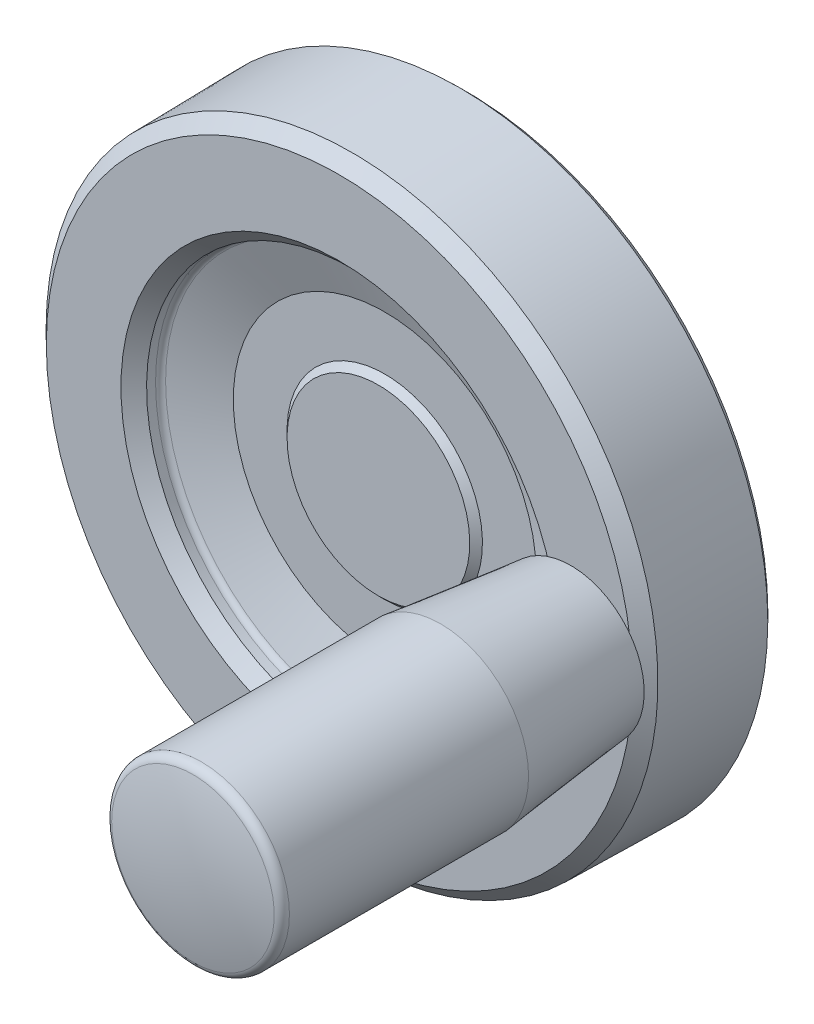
ISO-10303-21;
HEADER;
FILE_DESCRIPTION(('STEP AP214'),'2;1');
FILE_NAME('part.step','',(''),(''),'','','');
FILE_SCHEMA(('AUTOMOTIVE_DESIGN { 1 0 10303 214 1 1 1 1 }'));
ENDSEC;
DATA;
#1=APPLICATION_CONTEXT('core data for automotive mechanical design processes');
#2=APPLICATION_PROTOCOL_DEFINITION('international standard','automotive_design',2000,#1);
#3=PRODUCT_CONTEXT('',#1,'mechanical');
#4=PRODUCT('Part','Part','',(#3));
#5=PRODUCT_RELATED_PRODUCT_CATEGORY('part','',(#4));
#6=PRODUCT_DEFINITION_FORMATION('','',#4);
#7=PRODUCT_DEFINITION_CONTEXT('part definition',#1,'design');
#8=PRODUCT_DEFINITION('design','',#6,#7);
#9=PRODUCT_DEFINITION_SHAPE('','',#8);
#10=(LENGTH_UNIT() NAMED_UNIT(*) SI_UNIT(.MILLI.,.METRE.));
#11=(NAMED_UNIT(*) PLANE_ANGLE_UNIT() SI_UNIT($,.RADIAN.));
#12=(NAMED_UNIT(*) SI_UNIT($,.STERADIAN.) SOLID_ANGLE_UNIT());
#13=UNCERTAINTY_MEASURE_WITH_UNIT(LENGTH_MEASURE(1.E-05),#10,'distance_accuracy_value','');
#14=(GEOMETRIC_REPRESENTATION_CONTEXT(3) GLOBAL_UNCERTAINTY_ASSIGNED_CONTEXT((#13)) GLOBAL_UNIT_ASSIGNED_CONTEXT((#10,
#11,#12)) REPRESENTATION_CONTEXT('',''));
#15=CARTESIAN_POINT('',(0.,0.,0.));
#16=DIRECTION('',(0.,0.,1.));
#17=DIRECTION('',(1.,0.,0.));
#18=AXIS2_PLACEMENT_3D('',#15,#16,#17);
#19=CARTESIAN_POINT('',(24.,0.,14.9999999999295));
#20=DIRECTION('',(0.,0.,-1.));
#21=DIRECTION('',(-1.,0.,0.));
#22=AXIS2_PLACEMENT_3D('',#19,#20,#21);
#23=CONICAL_SURFACE('',#22,2.99999999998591,0.785398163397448);
#24=CARTESIAN_POINT('',(24.,0.,15.3067499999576));
#25=DIRECTION('',(0.,0.,1.));
#26=DIRECTION('',(0.,1.,0.));
#27=AXIS2_PLACEMENT_3D('',#24,#25,#26);
#28=CIRCLE('',#27,2.69324999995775);
#29=CARTESIAN_POINT('',(24.,2.69324999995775,15.3067499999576));
#30=VERTEX_POINT('',#29);
#31=EDGE_CURVE('E756',#30,#30,#28,.T.);
#32=ORIENTED_EDGE('',*,*,#31,.T.);
#33=EDGE_LOOP('',(#32));
#34=FACE_BOUND('',#33,.T.);
#35=CARTESIAN_POINT('',(24.,0.,14.9999999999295));
#36=DIRECTION('',(0.,0.,-1.));
#37=DIRECTION('',(-1.,0.,0.));
#38=AXIS2_PLACEMENT_3D('',#35,#36,#37);
#39=CIRCLE('',#38,2.9999999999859);
#40=CARTESIAN_POINT('',(21.0000000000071,0.,14.9999999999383));
#41=VERTEX_POINT('',#40);
#42=EDGE_CURVE('E18',#41,#41,#39,.T.);
#43=ORIENTED_EDGE('',*,*,#42,.T.);
#44=EDGE_LOOP('',(#43));
#45=FACE_BOUND('',#44,.T.);
#46=ADVANCED_FACE('F14',(#34,#45),#23,.F.);
#47=CARTESIAN_POINT('',(24.,0.,15.613499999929));
#48=DIRECTION('',(0.,0.,1.));
#49=DIRECTION('',(-1.,0.,0.));
#50=AXIS2_PLACEMENT_3D('',#47,#48,#49);
#51=CONICAL_SURFACE('',#50,2.99999999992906,0.785398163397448);
#52=CARTESIAN_POINT('',(24.,0.,15.));
#53=DIRECTION('',(0.,0.,1.));
#54=DIRECTION('',(-1.,0.,0.));
#55=AXIS2_PLACEMENT_3D('',#52,#53,#54);
#56=CIRCLE('',#55,2.38650000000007);
#57=CARTESIAN_POINT('',(21.6134999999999,0.,15.));
#58=VERTEX_POINT('',#57);
#59=EDGE_CURVE('E759',#58,#58,#56,.T.);
#60=ORIENTED_EDGE('',*,*,#59,.T.);
#61=EDGE_LOOP('',(#60));
#62=FACE_BOUND('',#61,.T.);
#63=ORIENTED_EDGE('',*,*,#31,.F.);
#64=EDGE_LOOP('',(#63));
#65=FACE_BOUND('',#64,.T.);
#66=ADVANCED_FACE('F240',(#62,#65),#51,.T.);
#67=CARTESIAN_POINT('',(24.,0.,15.));
#68=DIRECTION('',(0.,0.,1.));
#69=DIRECTION('',(-1.,0.,0.));
#70=AXIS2_PLACEMENT_3D('',#67,#68,#69);
#71=PLANE('',#70);
#72=DIRECTION('',(0.866025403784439,-0.5,0.));
#73=VECTOR('',#72,1.);
#74=CARTESIAN_POINT('',(25.5,0.866025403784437,15.));
#75=LINE('',#74,#73);
#76=CARTESIAN_POINT('',(24.,1.73205080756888,15.));
#77=VERTEX_POINT('',#76);
#78=CARTESIAN_POINT('',(25.5,0.866025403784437,15.));
#79=VERTEX_POINT('',#78);
#80=EDGE_CURVE('E762',#77,#79,#75,.T.);
#81=ORIENTED_EDGE('',*,*,#80,.F.);
#82=DIRECTION('',(0.866025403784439,0.5,0.));
#83=VECTOR('',#82,1.);
#84=CARTESIAN_POINT('',(24.,1.73205080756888,15.));
#85=LINE('',#84,#83);
#86=CARTESIAN_POINT('',(22.5,0.866025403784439,15.));
#87=VERTEX_POINT('',#86);
#88=EDGE_CURVE('E764',#87,#77,#85,.T.);
#89=ORIENTED_EDGE('',*,*,#88,.F.);
#90=DIRECTION('',(0.,-1.,0.));
#91=VECTOR('',#90,1.);
#92=CARTESIAN_POINT('',(22.5,0.866025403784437,15.));
#93=LINE('',#92,#91);
#94=CARTESIAN_POINT('',(22.5,-0.86602540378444,15.));
#95=VERTEX_POINT('',#94);
#96=EDGE_CURVE('E767',#95,#87,#93,.F.);
#97=ORIENTED_EDGE('',*,*,#96,.F.);
#98=DIRECTION('',(-0.866025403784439,0.5,0.));
#99=VECTOR('',#98,1.);
#100=CARTESIAN_POINT('',(22.5,-0.866025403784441,15.));
#101=LINE('',#100,#99);
#102=CARTESIAN_POINT('',(24.,-1.73205080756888,15.));
#103=VERTEX_POINT('',#102);
#104=EDGE_CURVE('E770',#103,#95,#101,.T.);
#105=ORIENTED_EDGE('',*,*,#104,.F.);
#106=DIRECTION('',(-0.866025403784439,-0.5,0.));
#107=VECTOR('',#106,1.);
#108=CARTESIAN_POINT('',(24.,-1.73205080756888,15.));
#109=LINE('',#108,#107);
#110=CARTESIAN_POINT('',(25.5,-0.866025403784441,15.));
#111=VERTEX_POINT('',#110);
#112=EDGE_CURVE('E773',#111,#103,#109,.T.);
#113=ORIENTED_EDGE('',*,*,#112,.F.);
#114=DIRECTION('',(0.,-1.,0.));
#115=VECTOR('',#114,1.);
#116=CARTESIAN_POINT('',(25.5,0.,15.));
#117=LINE('',#116,#115);
#118=EDGE_CURVE('E776',#79,#111,#117,.T.);
#119=ORIENTED_EDGE('',*,*,#118,.F.);
#120=EDGE_LOOP('',(#81,#89,#97,#105,#113,#119));
#121=FACE_BOUND('',#120,.T.);
#122=ORIENTED_EDGE('',*,*,#59,.F.);
#123=EDGE_LOOP('',(#122));
#124=FACE_BOUND('',#123,.T.);
#125=ADVANCED_FACE('F244',(#121,#124),#71,.F.);
#126=CARTESIAN_POINT('',(25.5,0.866025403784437,18.25));
#127=DIRECTION('',(-0.5,-0.866025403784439,0.));
#128=DIRECTION('',(0.866025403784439,-0.5,0.));
#129=AXIS2_PLACEMENT_3D('',#126,#127,#128);
#130=PLANE('',#129);
#131=DIRECTION('',(0.866025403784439,-0.5,0.));
#132=VECTOR('',#131,1.);
#133=CARTESIAN_POINT('',(25.5,0.866025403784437,18.25));
#134=LINE('',#133,#132);
#135=CARTESIAN_POINT('',(24.7500000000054,1.29903810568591,18.2499999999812));
#136=VERTEX_POINT('',#135);
#137=CARTESIAN_POINT('',(24.,1.73205080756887,18.25));
#138=VERTEX_POINT('',#137);
#139=EDGE_CURVE('E779',#136,#138,#134,.F.);
#140=ORIENTED_EDGE('',*,*,#139,.T.);
#141=DIRECTION('',(0.,0.,1.));
#142=VECTOR('',#141,1.);
#143=CARTESIAN_POINT('',(24.,1.73205080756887,18.25));
#144=LINE('',#143,#142);
#145=EDGE_CURVE('E781',#138,#77,#144,.F.);
#146=ORIENTED_EDGE('',*,*,#145,.T.);
#147=ORIENTED_EDGE('',*,*,#80,.T.);
#148=DIRECTION('',(0.,0.,-1.));
#149=VECTOR('',#148,1.);
#150=CARTESIAN_POINT('',(25.5,0.866025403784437,18.25));
#151=LINE('',#150,#149);
#152=CARTESIAN_POINT('',(25.5,0.866025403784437,18.25));
#153=VERTEX_POINT('',#152);
#154=EDGE_CURVE('E784',#153,#79,#151,.T.);
#155=ORIENTED_EDGE('',*,*,#154,.F.);
#156=DIRECTION('',(0.866025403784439,-0.5,0.));
#157=VECTOR('',#156,1.);
#158=CARTESIAN_POINT('',(25.5,0.866025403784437,18.25));
#159=LINE('',#158,#157);
#160=EDGE_CURVE('E787',#153,#136,#159,.F.);
#161=ORIENTED_EDGE('',*,*,#160,.T.);
#162=EDGE_LOOP('',(#140,#146,#147,#155,#161));
#163=FACE_BOUND('',#162,.T.);
#164=ADVANCED_FACE('F248',(#163),#130,.T.);
#165=CARTESIAN_POINT('',(24.,1.73205080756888,18.25));
#166=DIRECTION('',(0.5,-0.866025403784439,0.));
#167=DIRECTION('',(0.866025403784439,0.5,0.));
#168=AXIS2_PLACEMENT_3D('',#165,#166,#167);
#169=PLANE('',#168);
#170=DIRECTION('',(0.866025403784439,0.5,0.));
#171=VECTOR('',#170,1.);
#172=CARTESIAN_POINT('',(24.,1.73205080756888,18.25));
#173=LINE('',#172,#171);
#174=CARTESIAN_POINT('',(23.2499999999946,1.29903810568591,18.2499999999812));
#175=VERTEX_POINT('',#174);
#176=CARTESIAN_POINT('',(22.5,0.866025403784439,18.25));
#177=VERTEX_POINT('',#176);
#178=EDGE_CURVE('E790',#175,#177,#173,.F.);
#179=ORIENTED_EDGE('',*,*,#178,.T.);
#180=DIRECTION('',(0.,0.,1.));
#181=VECTOR('',#180,1.);
#182=CARTESIAN_POINT('',(22.5,0.86602540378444,18.25));
#183=LINE('',#182,#181);
#184=EDGE_CURVE('E792',#177,#87,#183,.F.);
#185=ORIENTED_EDGE('',*,*,#184,.T.);
#186=ORIENTED_EDGE('',*,*,#88,.T.);
#187=ORIENTED_EDGE('',*,*,#145,.F.);
#188=DIRECTION('',(0.866025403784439,0.5,0.));
#189=VECTOR('',#188,1.);
#190=CARTESIAN_POINT('',(24.,1.73205080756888,18.25));
#191=LINE('',#190,#189);
#192=EDGE_CURVE('E795',#138,#175,#191,.F.);
#193=ORIENTED_EDGE('',*,*,#192,.T.);
#194=EDGE_LOOP('',(#179,#185,#186,#187,#193));
#195=FACE_BOUND('',#194,.T.);
#196=ADVANCED_FACE('F252',(#195),#169,.T.);
#197=CARTESIAN_POINT('',(22.5,0.866025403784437,18.25));
#198=DIRECTION('',(1.,0.,0.));
#199=DIRECTION('',(0.,0.,1.));
#200=AXIS2_PLACEMENT_3D('',#197,#198,#199);
#201=PLANE('',#200);
#202=DIRECTION('',(0.,-1.,0.));
#203=VECTOR('',#202,1.);
#204=CARTESIAN_POINT('',(22.5,0.866025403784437,18.25));
#205=LINE('',#204,#203);
#206=CARTESIAN_POINT('',(22.4999999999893,0.,18.2499999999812));
#207=VERTEX_POINT('',#206);
#208=CARTESIAN_POINT('',(22.5,-0.86602540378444,18.25));
#209=VERTEX_POINT('',#208);
#210=EDGE_CURVE('E798',#207,#209,#205,.T.);
#211=ORIENTED_EDGE('',*,*,#210,.T.);
#212=DIRECTION('',(0.,0.,1.));
#213=VECTOR('',#212,1.);
#214=CARTESIAN_POINT('',(22.5,-0.86602540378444,18.25));
#215=LINE('',#214,#213);
#216=EDGE_CURVE('E800',#95,#209,#215,.T.);
#217=ORIENTED_EDGE('',*,*,#216,.F.);
#218=ORIENTED_EDGE('',*,*,#96,.T.);
#219=ORIENTED_EDGE('',*,*,#184,.F.);
#220=DIRECTION('',(0.,-1.,0.));
#221=VECTOR('',#220,1.);
#222=CARTESIAN_POINT('',(22.5,0.866025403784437,18.25));
#223=LINE('',#222,#221);
#224=EDGE_CURVE('E803',#177,#207,#223,.T.);
#225=ORIENTED_EDGE('',*,*,#224,.T.);
#226=EDGE_LOOP('',(#211,#217,#218,#219,#225));
#227=FACE_BOUND('',#226,.T.);
#228=ADVANCED_FACE('F256',(#227),#201,.T.);
#229=CARTESIAN_POINT('',(22.5,-0.866025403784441,18.25));
#230=DIRECTION('',(0.5,0.866025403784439,0.));
#231=DIRECTION('',(-0.866025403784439,0.5,0.));
#232=AXIS2_PLACEMENT_3D('',#229,#230,#231);
#233=PLANE('',#232);
#234=DIRECTION('',(0.866025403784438,-0.5,0.));
#235=VECTOR('',#234,1.);
#236=CARTESIAN_POINT('',(23.25,-1.29903810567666,18.25));
#237=LINE('',#236,#235);
#238=CARTESIAN_POINT('',(23.2499999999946,-1.29903810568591,18.2499999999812));
#239=VERTEX_POINT('',#238);
#240=CARTESIAN_POINT('',(24.,-1.73205080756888,18.25));
#241=VERTEX_POINT('',#240);
#242=EDGE_CURVE('E806',#239,#241,#237,.T.);
#243=ORIENTED_EDGE('',*,*,#242,.T.);
#244=DIRECTION('',(0.,0.,1.));
#245=VECTOR('',#244,1.);
#246=CARTESIAN_POINT('',(24.,-1.73205080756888,18.25));
#247=LINE('',#246,#245);
#248=EDGE_CURVE('E808',#103,#241,#247,.T.);
#249=ORIENTED_EDGE('',*,*,#248,.F.);
#250=ORIENTED_EDGE('',*,*,#104,.T.);
#251=ORIENTED_EDGE('',*,*,#216,.T.);
#252=DIRECTION('',(-0.866025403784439,0.5,0.));
#253=VECTOR('',#252,1.);
#254=CARTESIAN_POINT('',(22.5,-0.866025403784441,18.25));
#255=LINE('',#254,#253);
#256=EDGE_CURVE('E811',#209,#239,#255,.F.);
#257=ORIENTED_EDGE('',*,*,#256,.T.);
#258=EDGE_LOOP('',(#243,#249,#250,#251,#257));
#259=FACE_BOUND('',#258,.T.);
#260=ADVANCED_FACE('F260',(#259),#233,.T.);
#261=CARTESIAN_POINT('',(24.,-1.73205080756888,18.25));
#262=DIRECTION('',(-0.5,0.866025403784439,0.));
#263=DIRECTION('',(-0.866025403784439,-0.5,0.));
#264=AXIS2_PLACEMENT_3D('',#261,#262,#263);
#265=PLANE('',#264);
#266=DIRECTION('',(0.866025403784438,0.5,0.));
#267=VECTOR('',#266,1.);
#268=CARTESIAN_POINT('',(24.75,-1.29903810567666,18.25));
#269=LINE('',#268,#267);
#270=CARTESIAN_POINT('',(24.7500000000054,-1.29903810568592,18.2499999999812));
#271=VERTEX_POINT('',#270);
#272=CARTESIAN_POINT('',(25.5,-0.866025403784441,18.25));
#273=VERTEX_POINT('',#272);
#274=EDGE_CURVE('E814',#271,#273,#269,.T.);
#275=ORIENTED_EDGE('',*,*,#274,.T.);
#276=DIRECTION('',(0.,0.,-1.));
#277=VECTOR('',#276,1.);
#278=CARTESIAN_POINT('',(25.5,-0.866025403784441,18.25));
#279=LINE('',#278,#277);
#280=EDGE_CURVE('E816',#111,#273,#279,.F.);
#281=ORIENTED_EDGE('',*,*,#280,.F.);
#282=ORIENTED_EDGE('',*,*,#112,.T.);
#283=ORIENTED_EDGE('',*,*,#248,.T.);
#284=DIRECTION('',(-0.866025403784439,-0.5,0.));
#285=VECTOR('',#284,1.);
#286=CARTESIAN_POINT('',(24.,-1.73205080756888,18.25));
#287=LINE('',#286,#285);
#288=EDGE_CURVE('E819',#241,#271,#287,.F.);
#289=ORIENTED_EDGE('',*,*,#288,.T.);
#290=EDGE_LOOP('',(#275,#281,#282,#283,#289));
#291=FACE_BOUND('',#290,.T.);
#292=ADVANCED_FACE('F264',(#291),#265,.T.);
#293=CARTESIAN_POINT('',(25.5,-0.866025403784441,18.25));
#294=DIRECTION('',(-1.,0.,0.));
#295=DIRECTION('',(0.,0.,-1.));
#296=AXIS2_PLACEMENT_3D('',#293,#294,#295);
#297=PLANE('',#296);
#298=DIRECTION('',(0.,-1.,0.));
#299=VECTOR('',#298,1.);
#300=CARTESIAN_POINT('',(25.5,-0.866025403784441,18.25));
#301=LINE('',#300,#299);
#302=CARTESIAN_POINT('',(25.5000000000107,0.,18.2499999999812));
#303=VERTEX_POINT('',#302);
#304=EDGE_CURVE('E822',#303,#153,#301,.F.);
#305=ORIENTED_EDGE('',*,*,#304,.T.);
#306=ORIENTED_EDGE('',*,*,#154,.T.);
#307=ORIENTED_EDGE('',*,*,#118,.T.);
#308=ORIENTED_EDGE('',*,*,#280,.T.);
#309=DIRECTION('',(0.,-1.,0.));
#310=VECTOR('',#309,1.);
#311=CARTESIAN_POINT('',(25.5,-0.866025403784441,18.25));
#312=LINE('',#311,#310);
#313=EDGE_CURVE('E825',#273,#303,#312,.F.);
#314=ORIENTED_EDGE('',*,*,#313,.T.);
#315=EDGE_LOOP('',(#305,#306,#307,#308,#314));
#316=FACE_BOUND('',#315,.T.);
#317=ADVANCED_FACE('F268',(#316),#297,.T.);
#318=CARTESIAN_POINT('',(24.,0.,18.25));
#319=DIRECTION('',(0.,0.,1.));
#320=DIRECTION('',(-1.,0.,0.));
#321=AXIS2_PLACEMENT_3D('',#318,#319,#320);
#322=PLANE('',#321);
#323=ORIENTED_EDGE('',*,*,#192,.F.);
#324=ORIENTED_EDGE('',*,*,#139,.F.);
#325=CARTESIAN_POINT('',(24.,0.,18.2499999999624));
#326=DIRECTION('',(0.,0.,-1.));
#327=DIRECTION('',(0.,1.,0.));
#328=AXIS2_PLACEMENT_3D('',#325,#326,#327);
#329=CIRCLE('',#328,1.50000000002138);
#330=EDGE_CURVE('E828',#175,#136,#329,.T.);
#331=ORIENTED_EDGE('',*,*,#330,.F.);
#332=EDGE_LOOP('',(#323,#324,#331));
#333=FACE_BOUND('',#332,.T.);
#334=ADVANCED_FACE('F272',(#333),#322,.F.);
#335=CARTESIAN_POINT('',(24.,0.,18.25));
#336=DIRECTION('',(0.,0.,1.));
#337=DIRECTION('',(-1.,0.,0.));
#338=AXIS2_PLACEMENT_3D('',#335,#336,#337);
#339=PLANE('',#338);
#340=ORIENTED_EDGE('',*,*,#160,.F.);
#341=ORIENTED_EDGE('',*,*,#304,.F.);
#342=CARTESIAN_POINT('',(24.,0.,18.2499999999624));
#343=DIRECTION('',(0.,0.,-1.));
#344=DIRECTION('',(0.,1.,0.));
#345=AXIS2_PLACEMENT_3D('',#342,#343,#344);
#346=CIRCLE('',#345,1.50000000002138);
#347=EDGE_CURVE('E831',#136,#303,#346,.T.);
#348=ORIENTED_EDGE('',*,*,#347,.F.);
#349=EDGE_LOOP('',(#340,#341,#348));
#350=FACE_BOUND('',#349,.T.);
#351=ADVANCED_FACE('F276',(#350),#339,.F.);
#352=CARTESIAN_POINT('',(24.,0.,18.25));
#353=DIRECTION('',(0.,0.,1.));
#354=DIRECTION('',(-1.,0.,0.));
#355=AXIS2_PLACEMENT_3D('',#352,#353,#354);
#356=PLANE('',#355);
#357=ORIENTED_EDGE('',*,*,#224,.F.);
#358=ORIENTED_EDGE('',*,*,#178,.F.);
#359=CARTESIAN_POINT('',(24.,0.,18.2499999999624));
#360=DIRECTION('',(0.,0.,-1.));
#361=DIRECTION('',(0.,1.,0.));
#362=AXIS2_PLACEMENT_3D('',#359,#360,#361);
#363=CIRCLE('',#362,1.50000000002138);
#364=EDGE_CURVE('E834',#175,#207,#363,.F.);
#365=ORIENTED_EDGE('',*,*,#364,.T.);
#366=EDGE_LOOP('',(#357,#358,#365));
#367=FACE_BOUND('',#366,.T.);
#368=ADVANCED_FACE('F280',(#367),#356,.F.);
#369=CARTESIAN_POINT('',(24.,0.,18.25));
#370=DIRECTION('',(0.,0.,1.));
#371=DIRECTION('',(-1.,0.,0.));
#372=AXIS2_PLACEMENT_3D('',#369,#370,#371);
#373=PLANE('',#372);
#374=ORIENTED_EDGE('',*,*,#256,.F.);
#375=ORIENTED_EDGE('',*,*,#210,.F.);
#376=CARTESIAN_POINT('',(24.,0.,18.2499999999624));
#377=DIRECTION('',(0.,0.,-1.));
#378=DIRECTION('',(0.,1.,0.));
#379=AXIS2_PLACEMENT_3D('',#376,#377,#378);
#380=CIRCLE('',#379,1.50000000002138);
#381=EDGE_CURVE('E837',#207,#239,#380,.F.);
#382=ORIENTED_EDGE('',*,*,#381,.T.);
#383=EDGE_LOOP('',(#374,#375,#382));
#384=FACE_BOUND('',#383,.T.);
#385=ADVANCED_FACE('F284',(#384),#373,.F.);
#386=CARTESIAN_POINT('',(24.,0.,18.25));
#387=DIRECTION('',(0.,0.,1.));
#388=DIRECTION('',(-1.,0.,0.));
#389=AXIS2_PLACEMENT_3D('',#386,#387,#388);
#390=PLANE('',#389);
#391=ORIENTED_EDGE('',*,*,#288,.F.);
#392=ORIENTED_EDGE('',*,*,#242,.F.);
#393=CARTESIAN_POINT('',(24.,0.,18.2499999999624));
#394=DIRECTION('',(0.,0.,-1.));
#395=DIRECTION('',(0.,1.,0.));
#396=AXIS2_PLACEMENT_3D('',#393,#394,#395);
#397=CIRCLE('',#396,1.50000000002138);
#398=EDGE_CURVE('E725',#239,#271,#397,.F.);
#399=ORIENTED_EDGE('',*,*,#398,.T.);
#400=EDGE_LOOP('',(#391,#392,#399));
#401=FACE_BOUND('',#400,.T.);
#402=ADVANCED_FACE('F288',(#401),#390,.F.);
#403=CARTESIAN_POINT('',(24.,0.,18.25));
#404=DIRECTION('',(0.,0.,1.));
#405=DIRECTION('',(-1.,0.,0.));
#406=AXIS2_PLACEMENT_3D('',#403,#404,#405);
#407=PLANE('',#406);
#408=ORIENTED_EDGE('',*,*,#313,.F.);
#409=ORIENTED_EDGE('',*,*,#274,.F.);
#410=CARTESIAN_POINT('',(24.,0.,18.2499999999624));
#411=DIRECTION('',(0.,0.,-1.));
#412=DIRECTION('',(0.,1.,0.));
#413=AXIS2_PLACEMENT_3D('',#410,#411,#412);
#414=CIRCLE('',#413,1.50000000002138);
#415=EDGE_CURVE('E720',#303,#271,#414,.T.);
#416=ORIENTED_EDGE('',*,*,#415,.F.);
#417=EDGE_LOOP('',(#408,#409,#416));
#418=FACE_BOUND('',#417,.T.);
#419=ADVANCED_FACE('F291',(#418),#407,.F.);
#420=CARTESIAN_POINT('',(24.,0.,18.2500000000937));
#421=DIRECTION('',(0.,0.,-1.));
#422=DIRECTION('',(0.,1.,0.));
#423=AXIS2_PLACEMENT_3D('',#420,#421,#422);
#424=CONICAL_SURFACE('',#423,1.499999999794,1.04719755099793);
#425=CARTESIAN_POINT('',(23.9999999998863,0.,19.1160254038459));
#426=VERTEX_POINT('',#425);
#427=VERTEX_LOOP('',#426);
#428=FACE_BOUND('',#427,.T.);
#429=ORIENTED_EDGE('',*,*,#398,.F.);
#430=ORIENTED_EDGE('',*,*,#381,.F.);
#431=ORIENTED_EDGE('',*,*,#364,.F.);
#432=ORIENTED_EDGE('',*,*,#330,.T.);
#433=ORIENTED_EDGE('',*,*,#347,.T.);
#434=ORIENTED_EDGE('',*,*,#415,.T.);
#435=EDGE_LOOP('',(#429,#430,#431,#432,#433,#434));
#436=FACE_BOUND('',#435,.T.);
#437=ADVANCED_FACE('F16',(#428,#436),#424,.F.);
#438=CARTESIAN_POINT('',(0.,0.,0.));
#439=DIRECTION('',(0.,0.,1.));
#440=DIRECTION('',(1.,0.,0.));
#441=AXIS2_PLACEMENT_3D('',#438,#439,#440);
#442=CYLINDRICAL_SURFACE('',#441,21.);
#443=CARTESIAN_POINT('',(0.,0.,15.));
#444=DIRECTION('',(0.,0.,1.));
#445=DIRECTION('',(1.,0.,0.));
#446=AXIS2_PLACEMENT_3D('',#443,#444,#445);
#447=CIRCLE('',#446,21.);
#448=EDGE_CURVE('E24',#41,#41,#447,.T.);
#449=ORIENTED_EDGE('',*,*,#448,.F.);
#450=EDGE_LOOP('',(#449));
#451=FACE_BOUND('',#450,.T.);
#452=CARTESIAN_POINT('',(0.,0.,15.9408336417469));
#453=DIRECTION('',(0.,0.,1.));
#454=DIRECTION('',(1.,0.,0.));
#455=AXIS2_PLACEMENT_3D('',#452,#453,#454);
#456=CIRCLE('',#455,21.);
#457=CARTESIAN_POINT('',(21.,0.,15.9408336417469));
#458=VERTEX_POINT('',#457);
#459=EDGE_CURVE('E718',#458,#458,#456,.F.);
#460=ORIENTED_EDGE('',*,*,#459,.F.);
#461=EDGE_LOOP('',(#460));
#462=FACE_BOUND('',#461,.T.);
#463=ADVANCED_FACE('F207',(#451,#462),#442,.F.);
#464=CARTESIAN_POINT('',(0.,0.,15.9408336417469));
#465=DIRECTION('',(0.,0.,-1.));
#466=DIRECTION('',(-1.,0.,0.));
#467=AXIS2_PLACEMENT_3D('',#464,#465,#466);
#468=TOROIDAL_SURFACE('',#467,20.35,0.65);
#469=ORIENTED_EDGE('',*,*,#459,.T.);
#470=EDGE_LOOP('',(#469));
#471=FACE_BOUND('',#470,.T.);
#472=CARTESIAN_POINT('',(0.,0.,16.5037501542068));
#473=DIRECTION('',(0.,0.,-1.));
#474=DIRECTION('',(-1.,0.,0.));
#475=AXIS2_PLACEMENT_3D('',#472,#473,#474);
#476=CIRCLE('',#475,20.025);
#477=CARTESIAN_POINT('',(-20.025,0.,16.5037501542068));
#478=VERTEX_POINT('',#477);
#479=EDGE_CURVE('E719',#478,#478,#476,.T.);
#480=ORIENTED_EDGE('',*,*,#479,.F.);
#481=EDGE_LOOP('',(#480));
#482=FACE_BOUND('',#481,.T.);
#483=ADVANCED_FACE('F202',(#471,#482),#468,.F.);
#484=CARTESIAN_POINT('',(0.,0.,16.5037501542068));
#485=DIRECTION('',(0.,0.,1.));
#486=DIRECTION('',(1.,0.,0.));
#487=AXIS2_PLACEMENT_3D('',#484,#485,#486);
#488=CONICAL_SURFACE('',#487,20.025,1.0471975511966);
#489=ORIENTED_EDGE('',*,*,#479,.T.);
#490=EDGE_LOOP('',(#489));
#491=FACE_BOUND('',#490,.T.);
#492=CARTESIAN_POINT('',(0.,0.,13.2128536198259));
#493=DIRECTION('',(0.,0.,1.));
#494=DIRECTION('',(1.,0.,0.));
#495=AXIS2_PLACEMENT_3D('',#492,#493,#494);
#496=CIRCLE('',#495,14.325);
#497=CARTESIAN_POINT('',(14.325,0.,13.2128536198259));
#498=VERTEX_POINT('',#497);
#499=EDGE_CURVE('E722',#498,#498,#496,.T.);
#500=ORIENTED_EDGE('',*,*,#499,.T.);
#501=EDGE_LOOP('',(#500));
#502=FACE_BOUND('',#501,.T.);
#503=ADVANCED_FACE('F206',(#491,#502),#488,.T.);
#504=CARTESIAN_POINT('',(0.,0.,12.649937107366));
#505=DIRECTION('',(0.,0.,-1.));
#506=DIRECTION('',(-1.,0.,0.));
#507=AXIS2_PLACEMENT_3D('',#504,#505,#506);
#508=TOROIDAL_SURFACE('',#507,14.65,0.65);
#509=ORIENTED_EDGE('',*,*,#499,.F.);
#510=EDGE_LOOP('',(#509));
#511=FACE_BOUND('',#510,.T.);
#512=CARTESIAN_POINT('',(0.,0.,12.649937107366));
#513=DIRECTION('',(0.,0.,-1.));
#514=DIRECTION('',(-1.,0.,0.));
#515=AXIS2_PLACEMENT_3D('',#512,#513,#514);
#516=CIRCLE('',#515,14.);
#517=CARTESIAN_POINT('',(-14.,0.,12.649937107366));
#518=VERTEX_POINT('',#517);
#519=EDGE_CURVE('E734',#518,#518,#516,.T.);
#520=ORIENTED_EDGE('',*,*,#519,.F.);
#521=EDGE_LOOP('',(#520));
#522=FACE_BOUND('',#521,.T.);
#523=ADVANCED_FACE('F212',(#511,#522),#508,.F.);
#524=CARTESIAN_POINT('',(0.,0.,0.));
#525=DIRECTION('',(0.,0.,1.));
#526=DIRECTION('',(1.,0.,0.));
#527=AXIS2_PLACEMENT_3D('',#524,#525,#526);
#528=CYLINDRICAL_SURFACE('',#527,14.);
#529=ORIENTED_EDGE('',*,*,#519,.T.);
#530=EDGE_LOOP('',(#529));
#531=FACE_BOUND('',#530,.T.);
#532=CARTESIAN_POINT('',(0.,0.,10.));
#533=DIRECTION('',(0.,0.,1.));
#534=DIRECTION('',(1.,0.,0.));
#535=AXIS2_PLACEMENT_3D('',#532,#533,#534);
#536=CIRCLE('',#535,14.);
#537=CARTESIAN_POINT('',(14.,0.,10.));
#538=VERTEX_POINT('',#537);
#539=EDGE_CURVE('E739',#538,#538,#536,.T.);
#540=ORIENTED_EDGE('',*,*,#539,.T.);
#541=EDGE_LOOP('',(#540));
#542=FACE_BOUND('',#541,.T.);
#543=ADVANCED_FACE('F216',(#531,#542),#528,.T.);
#544=CARTESIAN_POINT('',(-14.,0.,10.));
#545=DIRECTION('',(0.,0.,1.));
#546=DIRECTION('',(1.,0.,0.));
#547=AXIS2_PLACEMENT_3D('',#544,#545,#546);
#548=PLANE('',#547);
#549=ORIENTED_EDGE('',*,*,#539,.F.);
#550=EDGE_LOOP('',(#549));
#551=FACE_BOUND('',#550,.T.);
#552=CARTESIAN_POINT('',(0.,0.,10.));
#553=DIRECTION('',(0.,0.,1.));
#554=DIRECTION('',(1.,0.,0.));
#555=AXIS2_PLACEMENT_3D('',#552,#553,#554);
#556=CIRCLE('',#555,10.);
#557=CARTESIAN_POINT('',(10.,0.,10.));
#558=VERTEX_POINT('',#557);
#559=EDGE_CURVE('E744',#558,#558,#556,.F.);
#560=ORIENTED_EDGE('',*,*,#559,.F.);
#561=EDGE_LOOP('',(#560));
#562=FACE_BOUND('',#561,.T.);
#563=ADVANCED_FACE('F220',(#551,#562),#548,.F.);
#564=CARTESIAN_POINT('',(0.,0.,0.));
#565=DIRECTION('',(0.,0.,1.));
#566=DIRECTION('',(1.,0.,0.));
#567=AXIS2_PLACEMENT_3D('',#564,#565,#566);
#568=CYLINDRICAL_SURFACE('',#567,10.);
#569=ORIENTED_EDGE('',*,*,#559,.T.);
#570=EDGE_LOOP('',(#569));
#571=FACE_BOUND('',#570,.T.);
#572=CARTESIAN_POINT('',(0.,0.,0.5));
#573=DIRECTION('',(0.,0.,1.));
#574=DIRECTION('',(1.,0.,0.));
#575=AXIS2_PLACEMENT_3D('',#572,#573,#574);
#576=CIRCLE('',#575,10.);
#577=CARTESIAN_POINT('',(10.,0.,0.5));
#578=VERTEX_POINT('',#577);
#579=EDGE_CURVE('E747',#578,#578,#576,.T.);
#580=ORIENTED_EDGE('',*,*,#579,.T.);
#581=EDGE_LOOP('',(#580));
#582=FACE_BOUND('',#581,.T.);
#583=ADVANCED_FACE('F224',(#571,#582),#568,.T.);
#584=CARTESIAN_POINT('',(0.,0.,0.5));
#585=DIRECTION('',(0.,0.,1.));
#586=DIRECTION('',(1.,0.,0.));
#587=AXIS2_PLACEMENT_3D('',#584,#585,#586);
#588=CONICAL_SURFACE('',#587,10.,0.785398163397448);
#589=ORIENTED_EDGE('',*,*,#579,.F.);
#590=EDGE_LOOP('',(#589));
#591=FACE_BOUND('',#590,.T.);
#592=CARTESIAN_POINT('',(0.,0.,0.));
#593=DIRECTION('',(0.,0.,1.));
#594=DIRECTION('',(1.,0.,0.));
#595=AXIS2_PLACEMENT_3D('',#592,#593,#594);
#596=CIRCLE('',#595,9.5);
#597=CARTESIAN_POINT('',(9.5,0.,0.));
#598=VERTEX_POINT('',#597);
#599=EDGE_CURVE('E750',#598,#598,#596,.T.);
#600=ORIENTED_EDGE('',*,*,#599,.T.);
#601=EDGE_LOOP('',(#600));
#602=FACE_BOUND('',#601,.T.);
#603=ADVANCED_FACE('F228',(#591,#602),#588,.T.);
#604=CARTESIAN_POINT('',(-9.5,0.,0.));
#605=DIRECTION('',(0.,0.,1.));
#606=DIRECTION('',(1.,0.,0.));
#607=AXIS2_PLACEMENT_3D('',#604,#605,#606);
#608=PLANE('',#607);
#609=ORIENTED_EDGE('',*,*,#599,.F.);
#610=EDGE_LOOP('',(#609));
#611=FACE_BOUND('',#610,.T.);
#612=ADVANCED_FACE('F232',(#611),#608,.F.);
#613=CARTESIAN_POINT('',(0.,0.,15.6499010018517));
#614=DIRECTION('',(0.,0.,1.));
#615=DIRECTION('',(1.,0.,0.));
#616=AXIS2_PLACEMENT_3D('',#613,#614,#615);
#617=CONICAL_SURFACE('',#616,31.5000017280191,0.776671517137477);
#618=CARTESIAN_POINT('',(0.,0.,15.6499010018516));
#619=DIRECTION('',(0.,0.,-1.));
#620=DIRECTION('',(-1.,0.,0.));
#621=AXIS2_PLACEMENT_3D('',#618,#619,#620);
#622=CIRCLE('',#621,31.5000017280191);
#623=CARTESIAN_POINT('',(-31.5000017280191,0.,15.6499010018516));
#624=VERTEX_POINT('',#623);
#625=EDGE_CURVE('E755',#624,#624,#622,.F.);
#626=ORIENTED_EDGE('',*,*,#625,.F.);
#627=EDGE_LOOP('',(#626));
#628=FACE_BOUND('',#627,.T.);
#629=CARTESIAN_POINT('',(0.,0.,15.));
#630=DIRECTION('',(0.,0.,1.));
#631=DIRECTION('',(1.,0.,0.));
#632=AXIS2_PLACEMENT_3D('',#629,#630,#631);
#633=CIRCLE('',#632,30.8613457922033);
#634=CARTESIAN_POINT('',(30.8613457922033,0.,15.));
#635=VERTEX_POINT('',#634);
#636=EDGE_CURVE('E9',#635,#635,#633,.T.);
#637=ORIENTED_EDGE('',*,*,#636,.T.);
#638=EDGE_LOOP('',(#637));
#639=FACE_BOUND('',#638,.T.);
#640=ADVANCED_FACE('F236',(#628,#639),#617,.T.);
#641=CARTESIAN_POINT('',(0.,0.,15.6499010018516));
#642=DIRECTION('',(0.,0.,-1.));
#643=DIRECTION('',(-1.,0.,0.));
#644=AXIS2_PLACEMENT_3D('',#641,#642,#643);
#645=CONICAL_SURFACE('',#644,31.5000017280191,0.0174532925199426);
#646=CARTESIAN_POINT('',(0.,0.,26.7001979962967));
#647=DIRECTION('',(0.,0.,-1.));
#648=DIRECTION('',(-1.,0.,0.));
#649=AXIS2_PLACEMENT_3D('',#646,#647,#648);
#650=CIRCLE('',#649,31.307118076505);
#651=CARTESIAN_POINT('',(-31.307118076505,0.,26.7001979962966));
#652=VERTEX_POINT('',#651);
#653=EDGE_CURVE('E868',#652,#652,#650,.T.);
#654=ORIENTED_EDGE('',*,*,#653,.T.);
#655=EDGE_LOOP('',(#654));
#656=FACE_BOUND('',#655,.T.);
#657=ORIENTED_EDGE('',*,*,#625,.T.);
#658=EDGE_LOOP('',(#657));
#659=FACE_BOUND('',#658,.T.);
#660=ADVANCED_FACE('F314',(#656,#659),#645,.T.);
#661=CARTESIAN_POINT('',(0.,0.,26.7001979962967));
#662=DIRECTION('',(0.,0.,-1.));
#663=DIRECTION('',(-1.,0.,0.));
#664=AXIS2_PLACEMENT_3D('',#661,#662,#663);
#665=CONICAL_SURFACE('',#664,31.307118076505,0.794124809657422);
#666=CARTESIAN_POINT('',(0.,0.,28.));
#667=DIRECTION('',(0.,0.,-1.));
#668=DIRECTION('',(-1.,0.,0.));
#669=AXIS2_PLACEMENT_3D('',#666,#667,#668);
#670=CIRCLE('',#669,29.9844299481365);
#671=CARTESIAN_POINT('',(-29.9844299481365,0.,28.));
#672=VERTEX_POINT('',#671);
#673=EDGE_CURVE('E115',#672,#672,#670,.T.);
#674=ORIENTED_EDGE('',*,*,#673,.T.);
#675=EDGE_LOOP('',(#674));
#676=FACE_BOUND('',#675,.T.);
#677=ORIENTED_EDGE('',*,*,#653,.F.);
#678=EDGE_LOOP('',(#677));
#679=FACE_BOUND('',#678,.T.);
#680=ADVANCED_FACE('F318',(#676,#679),#665,.T.);
#681=CARTESIAN_POINT('',(-22.3462238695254,0.,28.));
#682=DIRECTION('',(0.,0.,-1.));
#683=DIRECTION('',(-1.,0.,0.));
#684=AXIS2_PLACEMENT_3D('',#681,#682,#683);
#685=PLANE('',#684);
#686=CARTESIAN_POINT('',(0.,0.,28.));
#687=DIRECTION('',(0.,0.,1.));
#688=DIRECTION('',(0.,1.,0.));
#689=AXIS2_PLACEMENT_3D('',#686,#687,#688);
#690=CIRCLE('',#689,22.3462238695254);
#691=CARTESIAN_POINT('',(22.0863275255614,3.3982138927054,28.));
#692=VERTEX_POINT('',#691);
#693=CARTESIAN_POINT('',(22.0863275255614,-3.3982138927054,28.));
#694=VERTEX_POINT('',#693);
#695=EDGE_CURVE('E106',#692,#694,#690,.T.);
#696=ORIENTED_EDGE('',*,*,#695,.F.);
#697=CARTESIAN_POINT('',(24.,0.,28.));
#698=DIRECTION('',(0.,0.,-1.));
#699=DIRECTION('',(-1.,0.,0.));
#700=AXIS2_PLACEMENT_3D('',#697,#698,#699);
#701=CIRCLE('',#700,3.9);
#702=EDGE_CURVE('E110',#692,#694,#701,.T.);
#703=ORIENTED_EDGE('',*,*,#702,.T.);
#704=EDGE_LOOP('',(#696,#703));
#705=FACE_BOUND('',#704,.T.);
#706=ORIENTED_EDGE('',*,*,#673,.F.);
#707=EDGE_LOOP('',(#706));
#708=FACE_BOUND('',#707,.T.);
#709=ADVANCED_FACE('F108',(#705,#708),#685,.F.);
#710=CARTESIAN_POINT('',(0.,0.,28.));
#711=DIRECTION('',(0.,0.,1.));
#712=DIRECTION('',(0.,1.,0.));
#713=AXIS2_PLACEMENT_3D('',#710,#711,#712);
#714=CONICAL_SURFACE('',#713,22.3462238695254,0.794124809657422);
#715=CARTESIAN_POINT('',(0.,0.,26.7001979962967));
#716=DIRECTION('',(0.,0.,1.));
#717=DIRECTION('',(1.,0.,0.));
#718=AXIS2_PLACEMENT_3D('',#715,#716,#717);
#719=CIRCLE('',#718,21.0235357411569);
#720=CARTESIAN_POINT('',(21.0235357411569,0.,26.7001979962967));
#721=VERTEX_POINT('',#720);
#722=EDGE_CURVE('E125',#721,#721,#719,.T.);
#723=ORIENTED_EDGE('',*,*,#722,.F.);
#724=EDGE_LOOP('',(#723));
#725=FACE_BOUND('',#724,.T.);
#726=CARTESIAN_POINT('',(22.2157025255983,-2.41169702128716,28.0000000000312));
#727=CARTESIAN_POINT('',(22.168635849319,-2.3056453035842,27.9427752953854));
#728=CARTESIAN_POINT('',(22.1234069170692,-2.19747294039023,27.8877758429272));
#729=CARTESIAN_POINT('',(22.0378121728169,-1.97734863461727,27.7836767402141));
#730=CARTESIAN_POINT('',(21.9974195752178,-1.86542236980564,27.7345445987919));
#731=CARTESIAN_POINT('',(21.9220541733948,-1.63683524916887,27.6428621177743));
#732=CARTESIAN_POINT('',(21.8870902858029,-1.52016699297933,27.600322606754));
#733=CARTESIAN_POINT('',(21.8235987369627,-1.28178481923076,27.5230670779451));
#734=CARTESIAN_POINT('',(21.7951100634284,-1.16004530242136,27.4883984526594));
#735=CARTESIAN_POINT('',(21.770542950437,-1.03621595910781,27.4585000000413));
#736=B_SPLINE_CURVE_WITH_KNOTS('',3,(#726,#727,#728,#729,#730,#731,#732,#733,#734,#735),
.UNSPECIFIED.,.F.,.F.,(4,2,2,2,4),(0.,0.388187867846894,0.774115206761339,1.16066987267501,
1.54949374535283),.UNSPECIFIED.);
#737=CARTESIAN_POINT('',(22.2157025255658,-2.41169702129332,28.0000000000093));
#738=VERTEX_POINT('',#737);
#739=CARTESIAN_POINT('',(21.7705429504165,-1.03621595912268,27.4585000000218));
#740=VERTEX_POINT('',#739);
#741=EDGE_CURVE('E332',#738,#740,#736,.T.);
#742=ORIENTED_EDGE('',*,*,#741,.T.);
#743=CARTESIAN_POINT('',(21.770542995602,1.03621605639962,27.45850004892));
#744=CARTESIAN_POINT('',(21.7510420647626,0.994254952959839,27.4373980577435));
#745=CARTESIAN_POINT('',(21.7325280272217,0.951322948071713,27.4173325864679));
#746=CARTESIAN_POINT('',(21.6976679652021,0.863554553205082,27.3795040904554));
#747=CARTESIAN_POINT('',(21.6813239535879,0.818716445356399,27.3617432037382));
#748=CARTESIAN_POINT('',(21.6357650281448,0.681139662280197,27.3121816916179));
#749=CARTESIAN_POINT('',(21.6101883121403,0.58568725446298,27.2842811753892));
#750=CARTESIAN_POINT('',(21.5704077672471,0.389112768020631,27.2408376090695));
#751=CARTESIAN_POINT('',(21.5562667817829,0.287962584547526,27.2253628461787));
#752=CARTESIAN_POINT('',(21.5408082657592,0.0838117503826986,27.208444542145));
#753=CARTESIAN_POINT('',(21.5394481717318,-0.0191816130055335,27.2069544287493));
#754=CARTESIAN_POINT('',(21.5491819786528,-0.216166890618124,27.2176094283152));
#755=CARTESIAN_POINT('',(21.5593652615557,-0.310262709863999,27.228757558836));
#756=CARTESIAN_POINT('',(21.5900083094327,-0.494915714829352,27.2622494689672));
#757=CARTESIAN_POINT('',(21.61049205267,-0.585464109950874,27.284619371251));
#758=CARTESIAN_POINT('',(21.653649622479,-0.737084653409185,27.3316422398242));
#759=CARTESIAN_POINT('',(21.6742252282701,-0.799494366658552,27.3540332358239));
#760=CARTESIAN_POINT('',(21.7194604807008,-0.920609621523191,27.4031658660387));
#761=CARTESIAN_POINT('',(21.7440976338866,-0.979333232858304,27.4298835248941));
#762=CARTESIAN_POINT('',(21.7705429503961,-1.03621595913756,27.4585000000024));
#763=B_SPLINE_CURVE_WITH_KNOTS('',3,(#743,#744,#745,#746,#747,#748,#749,#750,#751,#752,#753,
#754,#755,#756,#757,#758,#759,#760,#761,#762),.UNSPECIFIED.,.F.,.F.,(4,2,2,2,2,2,2,2,2,4),(0.,
0.152513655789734,0.305167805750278,0.611739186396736,0.919984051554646,1.22720202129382,
1.51177436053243,1.79701223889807,2.00494289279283,2.21175846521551),.UNSPECIFIED.);
#764=CARTESIAN_POINT('',(21.7705431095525,1.03621630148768,27.4585000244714));
#765=VERTEX_POINT('',#764);
#766=EDGE_CURVE('E338',#765,#740,#763,.T.);
#767=ORIENTED_EDGE('',*,*,#766,.F.);
#768=CARTESIAN_POINT('',(21.7705429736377,1.03621607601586,27.4585000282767));
#769=CARTESIAN_POINT('',(21.7951100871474,1.16004540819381,27.4883984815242));
#770=CARTESIAN_POINT('',(21.8235987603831,1.28178491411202,27.5230671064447));
#771=CARTESIAN_POINT('',(21.8870903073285,1.52016706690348,27.6003226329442));
#772=CARTESIAN_POINT('',(21.9220541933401,1.63683531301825,27.6428621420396));
#773=CARTESIAN_POINT('',(21.9974195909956,1.8654224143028,27.734544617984));
#774=CARTESIAN_POINT('',(22.0378121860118,1.9773486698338,27.7836767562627));
#775=CARTESIAN_POINT('',(22.1234069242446,2.19747295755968,27.8877758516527));
#776=CARTESIAN_POINT('',(22.1686358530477,2.3056453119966,27.9427752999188));
#777=CARTESIAN_POINT('',(22.2157025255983,2.41169702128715,28.0000000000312));
#778=B_SPLINE_CURVE_WITH_KNOTS('',3,(#768,#769,#770,#771,#772,#773,#774,#775,#776,#777),
.UNSPECIFIED.,.F.,.F.,(4,2,2,2,4),(0.,0.388823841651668,0.775378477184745,1.16130578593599,
1.54949362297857),.UNSPECIFIED.);
#779=CARTESIAN_POINT('',(22.2157025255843,2.4116970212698,28.0000000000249));
#780=VERTEX_POINT('',#779);
#781=EDGE_CURVE('E130',#765,#780,#778,.T.);
#782=ORIENTED_EDGE('',*,*,#781,.T.);
#783=EDGE_CURVE('E118',#780,#692,#690,.T.);
#784=ORIENTED_EDGE('',*,*,#783,.T.);
#785=ORIENTED_EDGE('',*,*,#695,.T.);
#786=EDGE_CURVE('E117',#694,#738,#690,.T.);
#787=ORIENTED_EDGE('',*,*,#786,.T.);
#788=EDGE_LOOP('',(#742,#767,#782,#784,#785,#787));
#789=FACE_BOUND('',#788,.T.);
#790=ADVANCED_FACE('F128',(#725,#789),#714,.F.);
#791=CARTESIAN_POINT('',(24.,0.,68.));
#792=DIRECTION('',(0.,0.,-1.));
#793=DIRECTION('',(1.,0.,0.));
#794=AXIS2_PLACEMENT_3D('',#791,#792,#793);
#795=CYLINDRICAL_SURFACE('',#794,3.9);
#796=CARTESIAN_POINT('',(24.,0.,28.));
#797=DIRECTION('',(0.,0.,-1.));
#798=DIRECTION('',(1.,0.,0.));
#799=AXIS2_PLACEMENT_3D('',#796,#797,#798);
#800=CIRCLE('',#799,3.9);
#801=EDGE_CURVE('E124',#692,#694,#800,.F.);
#802=ORIENTED_EDGE('',*,*,#801,.T.);
#803=ORIENTED_EDGE('',*,*,#702,.F.);
#804=EDGE_LOOP('',(#802,#803));
#805=FACE_BOUND('',#804,.T.);
#806=CARTESIAN_POINT('',(24.,0.,28.3));
#807=DIRECTION('',(0.,0.,-1.));
#808=DIRECTION('',(1.,0.,0.));
#809=AXIS2_PLACEMENT_3D('',#806,#807,#808);
#810=CIRCLE('',#809,3.9);
#811=CARTESIAN_POINT('',(27.9,0.,28.3));
#812=VERTEX_POINT('',#811);
#813=EDGE_CURVE('E135',#812,#812,#810,.T.);
#814=ORIENTED_EDGE('',*,*,#813,.T.);
#815=EDGE_LOOP('',(#814));
#816=FACE_BOUND('',#815,.T.);
#817=ADVANCED_FACE('F121',(#805,#816),#795,.T.);
#818=CARTESIAN_POINT('',(0.,0.,26.7001979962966));
#819=DIRECTION('',(0.,0.,1.));
#820=DIRECTION('',(0.,1.,0.));
#821=AXIS2_PLACEMENT_3D('',#818,#819,#820);
#822=CONICAL_SURFACE('',#821,21.023535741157,0.0174532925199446);
#823=CARTESIAN_POINT('',(0.,0.,25.798500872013));
#824=DIRECTION('',(0.,0.,1.));
#825=DIRECTION('',(1.,0.,0.));
#826=AXIS2_PLACEMENT_3D('',#823,#824,#825);
#827=CIRCLE('',#826,21.007796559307);
#828=CARTESIAN_POINT('',(21.007796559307,0.,25.7985008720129));
#829=VERTEX_POINT('',#828);
#830=EDGE_CURVE('E138',#829,#829,#827,.T.);
#831=ORIENTED_EDGE('',*,*,#830,.F.);
#832=EDGE_LOOP('',(#831));
#833=FACE_BOUND('',#832,.T.);
#834=ORIENTED_EDGE('',*,*,#722,.T.);
#835=EDGE_LOOP('',(#834));
#836=FACE_BOUND('',#835,.T.);
#837=ADVANCED_FACE('F446',(#833,#836),#822,.F.);
#838=CARTESIAN_POINT('',(24.,0.,27.9999999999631));
#839=DIRECTION('',(0.,0.,1.));
#840=DIRECTION('',(1.,0.,0.));
#841=AXIS2_PLACEMENT_3D('',#838,#839,#840);
#842=CONICAL_SURFACE('',#841,2.99999999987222,0.785398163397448);
#843=CARTESIAN_POINT('',(24.,0.,27.458500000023));
#844=DIRECTION('',(0.,0.,1.));
#845=DIRECTION('',(0.,1.,0.));
#846=AXIS2_PLACEMENT_3D('',#843,#844,#845);
#847=CIRCLE('',#846,2.45849999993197);
#848=EDGE_CURVE('E151',#740,#765,#847,.T.);
#849=ORIENTED_EDGE('',*,*,#848,.F.);
#850=ORIENTED_EDGE('',*,*,#741,.F.);
#851=CARTESIAN_POINT('',(24.,0.,28.00000000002));
#852=DIRECTION('',(0.,0.,1.));
#853=DIRECTION('',(1.,0.,0.));
#854=AXIS2_PLACEMENT_3D('',#851,#852,#853);
#855=CIRCLE('',#854,2.99999999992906);
#856=EDGE_CURVE('E156',#738,#780,#855,.T.);
#857=ORIENTED_EDGE('',*,*,#856,.T.);
#858=ORIENTED_EDGE('',*,*,#781,.F.);
#859=EDGE_LOOP('',(#849,#850,#857,#858));
#860=FACE_BOUND('',#859,.T.);
#861=ADVANCED_FACE('F349',(#860),#842,.F.);
#862=CARTESIAN_POINT('',(24.,0.,15.));
#863=DIRECTION('',(0.,0.,1.));
#864=DIRECTION('',(0.,1.,0.));
#865=AXIS2_PLACEMENT_3D('',#862,#863,#864);
#866=CYLINDRICAL_SURFACE('',#865,2.4585);
#867=ORIENTED_EDGE('',*,*,#766,.T.);
#868=ORIENTED_EDGE('',*,*,#848,.T.);
#869=EDGE_LOOP('',(#867,#868));
#870=FACE_BOUND('',#869,.T.);
#871=CARTESIAN_POINT('',(24.,0.,25.4));
#872=DIRECTION('',(0.,0.,-1.));
#873=DIRECTION('',(0.,-1.,0.));
#874=AXIS2_PLACEMENT_3D('',#871,#872,#873);
#875=CIRCLE('',#874,2.4585);
#876=CARTESIAN_POINT('',(24.,-2.4585,25.4));
#877=VERTEX_POINT('',#876);
#878=EDGE_CURVE('E158',#877,#877,#875,.F.);
#879=ORIENTED_EDGE('',*,*,#878,.F.);
#880=EDGE_LOOP('',(#879));
#881=FACE_BOUND('',#880,.T.);
#882=ADVANCED_FACE('F345',(#870,#881),#866,.F.);
#883=CARTESIAN_POINT('',(24.,0.,28.));
#884=DIRECTION('',(0.,0.,1.));
#885=DIRECTION('',(-1.,0.,0.));
#886=AXIS2_PLACEMENT_3D('',#883,#884,#885);
#887=PLANE('',#886);
#888=CARTESIAN_POINT('',(24.,0.,28.));
#889=DIRECTION('',(0.,0.,-1.));
#890=DIRECTION('',(1.,0.,0.));
#891=AXIS2_PLACEMENT_3D('',#888,#889,#890);
#892=CIRCLE('',#891,2.14785);
#893=CARTESIAN_POINT('',(26.14785,0.,28.));
#894=VERTEX_POINT('',#893);
#895=EDGE_CURVE('E161',#894,#894,#892,.T.);
#896=ORIENTED_EDGE('',*,*,#895,.F.);
#897=EDGE_LOOP('',(#896));
#898=FACE_BOUND('',#897,.T.);
#899=ORIENTED_EDGE('',*,*,#801,.F.);
#900=ORIENTED_EDGE('',*,*,#783,.F.);
#901=ORIENTED_EDGE('',*,*,#856,.F.);
#902=ORIENTED_EDGE('',*,*,#786,.F.);
#903=EDGE_LOOP('',(#899,#900,#901,#902));
#904=FACE_BOUND('',#903,.T.);
#905=ADVANCED_FACE('F134',(#898,#904),#887,.F.);
#906=CARTESIAN_POINT('',(24.,-3.9,28.3));
#907=DIRECTION('',(0.,0.,1.));
#908=DIRECTION('',(-1.,0.,0.));
#909=AXIS2_PLACEMENT_3D('',#906,#907,#908);
#910=PLANE('',#909);
#911=ORIENTED_EDGE('',*,*,#813,.F.);
#912=EDGE_LOOP('',(#911));
#913=FACE_BOUND('',#912,.T.);
#914=CARTESIAN_POINT('',(24.,0.,28.3));
#915=DIRECTION('',(0.,0.,1.));
#916=DIRECTION('',(-1.,0.,0.));
#917=AXIS2_PLACEMENT_3D('',#914,#915,#916);
#918=CIRCLE('',#917,7.5);
#919=CARTESIAN_POINT('',(16.5,0.,28.3));
#920=VERTEX_POINT('',#919);
#921=EDGE_CURVE('E164',#920,#920,#918,.T.);
#922=ORIENTED_EDGE('',*,*,#921,.F.);
#923=EDGE_LOOP('',(#922));
#924=FACE_BOUND('',#923,.T.);
#925=ADVANCED_FACE('F354',(#913,#924),#910,.F.);
#926=CARTESIAN_POINT('',(0.,0.,25.8098449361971));
#927=DIRECTION('',(0.,0.,-1.));
#928=DIRECTION('',(-1.,0.,0.));
#929=AXIS2_PLACEMENT_3D('',#926,#927,#928);
#930=TOROIDAL_SURFACE('',#929,20.3578955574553,0.650000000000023);
#931=CARTESIAN_POINT('',(0.,0.,25.1990447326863));
#932=DIRECTION('',(0.,0.,-1.));
#933=DIRECTION('',(-1.,0.,0.));
#934=AXIS2_PLACEMENT_3D('',#931,#932,#933);
#935=CIRCLE('',#934,20.5802086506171);
#936=CARTESIAN_POINT('',(-20.5802086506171,0.,25.1990447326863));
#937=VERTEX_POINT('',#936);
#938=EDGE_CURVE('E167',#937,#937,#935,.F.);
#939=ORIENTED_EDGE('',*,*,#938,.F.);
#940=EDGE_LOOP('',(#939));
#941=FACE_BOUND('',#940,.T.);
#942=ORIENTED_EDGE('',*,*,#830,.T.);
#943=EDGE_LOOP('',(#942));
#944=FACE_BOUND('',#943,.T.);
#945=ADVANCED_FACE('F358',(#941,#944),#930,.F.);
#946=CARTESIAN_POINT('',(24.,-3.,25.4));
#947=DIRECTION('',(0.,0.,-1.));
#948=DIRECTION('',(1.,0.,0.));
#949=AXIS2_PLACEMENT_3D('',#946,#947,#948);
#950=PLANE('',#949);
#951=CARTESIAN_POINT('',(24.,0.,25.4));
#952=DIRECTION('',(0.,0.,-1.));
#953=DIRECTION('',(1.,0.,0.));
#954=AXIS2_PLACEMENT_3D('',#951,#952,#953);
#955=CIRCLE('',#954,2.14785);
#956=CARTESIAN_POINT('',(26.14785,0.,25.4));
#957=VERTEX_POINT('',#956);
#958=EDGE_CURVE('E170',#957,#957,#955,.F.);
#959=ORIENTED_EDGE('',*,*,#958,.F.);
#960=EDGE_LOOP('',(#959));
#961=FACE_BOUND('',#960,.T.);
#962=ORIENTED_EDGE('',*,*,#878,.T.);
#963=EDGE_LOOP('',(#962));
#964=FACE_BOUND('',#963,.T.);
#965=ADVANCED_FACE('F363',(#961,#964),#950,.F.);
#966=CARTESIAN_POINT('',(24.,0.,35.));
#967=DIRECTION('',(0.,0.,-1.));
#968=DIRECTION('',(1.,0.,0.));
#969=AXIS2_PLACEMENT_3D('',#966,#967,#968);
#970=CYLINDRICAL_SURFACE('',#969,2.14785);
#971=ORIENTED_EDGE('',*,*,#958,.T.);
#972=EDGE_LOOP('',(#971));
#973=FACE_BOUND('',#972,.T.);
#974=ORIENTED_EDGE('',*,*,#895,.T.);
#975=EDGE_LOOP('',(#974));
#976=FACE_BOUND('',#975,.T.);
#977=ADVANCED_FACE('F406',(#973,#976),#970,.T.);
#978=CARTESIAN_POINT('',(24.,0.,41.6333333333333));
#979=DIRECTION('',(0.,0.,1.));
#980=DIRECTION('',(-1.,0.,0.));
#981=AXIS2_PLACEMENT_3D('',#978,#979,#980);
#982=CONICAL_SURFACE('',#981,9.,0.112028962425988);
#983=ORIENTED_EDGE('',*,*,#921,.T.);
#984=EDGE_LOOP('',(#983));
#985=FACE_BOUND('',#984,.T.);
#986=CARTESIAN_POINT('',(24.,0.,41.6333333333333));
#987=DIRECTION('',(0.,0.,-1.));
#988=DIRECTION('',(1.,0.,0.));
#989=AXIS2_PLACEMENT_3D('',#986,#987,#988);
#990=CIRCLE('',#989,9.);
#991=CARTESIAN_POINT('',(33.,0.,41.6333333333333));
#992=VERTEX_POINT('',#991);
#993=EDGE_CURVE('E175',#992,#992,#990,.F.);
#994=ORIENTED_EDGE('',*,*,#993,.F.);
#995=EDGE_LOOP('',(#994));
#996=FACE_BOUND('',#995,.T.);
#997=ADVANCED_FACE('F401',(#985,#996),#982,.T.);
#998=CARTESIAN_POINT('',(0.,0.,25.1990447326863));
#999=DIRECTION('',(0.,0.,1.));
#1000=DIRECTION('',(1.,0.,0.));
#1001=AXIS2_PLACEMENT_3D('',#998,#999,#1000);
#1002=CONICAL_SURFACE('',#1001,20.580208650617,1.22173047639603);
#1003=CARTESIAN_POINT('',(0.,0.,23.35));
#1004=DIRECTION('',(0.,0.,1.));
#1005=DIRECTION('',(1.,0.,0.));
#1006=AXIS2_PLACEMENT_3D('',#1003,#1004,#1005);
#1007=CIRCLE('',#1006,15.5);
#1008=CARTESIAN_POINT('',(15.5,0.,23.35));
#1009=VERTEX_POINT('',#1008);
#1010=EDGE_CURVE('E178',#1009,#1009,#1007,.T.);
#1011=ORIENTED_EDGE('',*,*,#1010,.F.);
#1012=EDGE_LOOP('',(#1011));
#1013=FACE_BOUND('',#1012,.T.);
#1014=ORIENTED_EDGE('',*,*,#938,.T.);
#1015=EDGE_LOOP('',(#1014));
#1016=FACE_BOUND('',#1015,.T.);
#1017=ADVANCED_FACE('F394',(#1013,#1016),#1002,.F.);
#1018=CARTESIAN_POINT('',(24.,0.,68.));
#1019=DIRECTION('',(0.,0.,-1.));
#1020=DIRECTION('',(1.,0.,0.));
#1021=AXIS2_PLACEMENT_3D('',#1018,#1019,#1020);
#1022=CYLINDRICAL_SURFACE('',#1021,9.);
#1023=ORIENTED_EDGE('',*,*,#993,.T.);
#1024=EDGE_LOOP('',(#1023));
#1025=FACE_BOUND('',#1024,.T.);
#1026=CARTESIAN_POINT('',(24.,0.,66.1044681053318));
#1027=DIRECTION('',(0.,0.,-1.));
#1028=DIRECTION('',(1.,0.,0.));
#1029=AXIS2_PLACEMENT_3D('',#1026,#1027,#1028);
#1030=CIRCLE('',#1029,9.);
#1031=CARTESIAN_POINT('',(33.,0.,66.1044681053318));
#1032=VERTEX_POINT('',#1031);
#1033=EDGE_CURVE('E183',#1032,#1032,#1030,.T.);
#1034=ORIENTED_EDGE('',*,*,#1033,.T.);
#1035=EDGE_LOOP('',(#1034));
#1036=FACE_BOUND('',#1035,.T.);
#1037=ADVANCED_FACE('F392',(#1025,#1036),#1022,.T.);
#1038=CARTESIAN_POINT('',(-10.,0.,23.35));
#1039=DIRECTION('',(0.,0.,-1.));
#1040=DIRECTION('',(-1.,0.,0.));
#1041=AXIS2_PLACEMENT_3D('',#1038,#1039,#1040);
#1042=PLANE('',#1041);
#1043=CARTESIAN_POINT('',(0.,0.,23.35));
#1044=DIRECTION('',(0.,0.,-1.));
#1045=DIRECTION('',(0.,-1.,0.));
#1046=AXIS2_PLACEMENT_3D('',#1043,#1044,#1045);
#1047=CIRCLE('',#1046,10.);
#1048=CARTESIAN_POINT('',(0.,-10.,23.35));
#1049=VERTEX_POINT('',#1048);
#1050=EDGE_CURVE('E186',#1049,#1049,#1047,.F.);
#1051=ORIENTED_EDGE('',*,*,#1050,.F.);
#1052=EDGE_LOOP('',(#1051));
#1053=FACE_BOUND('',#1052,.T.);
#1054=ORIENTED_EDGE('',*,*,#1010,.T.);
#1055=EDGE_LOOP('',(#1054));
#1056=FACE_BOUND('',#1055,.T.);
#1057=ADVANCED_FACE('F378',(#1053,#1056),#1042,.F.);
#1058=CARTESIAN_POINT('',(24.,0.,66.1044681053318));
#1059=DIRECTION('',(0.,0.,1.));
#1060=DIRECTION('',(-1.,0.,0.));
#1061=AXIS2_PLACEMENT_3D('',#1058,#1059,#1060);
#1062=TOROIDAL_SURFACE('',#1061,8.1,0.9);
#1063=CARTESIAN_POINT('',(24.,0.,66.977682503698));
#1064=DIRECTION('',(0.,0.,1.));
#1065=DIRECTION('',(-1.,0.,0.));
#1066=AXIS2_PLACEMENT_3D('',#1063,#1064,#1065);
#1067=CIRCLE('',#1066,8.31793718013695);
#1068=CARTESIAN_POINT('',(15.682062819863,0.,66.977682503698));
#1069=VERTEX_POINT('',#1068);
#1070=EDGE_CURVE('E191',#1069,#1069,#1067,.F.);
#1071=ORIENTED_EDGE('',*,*,#1070,.T.);
#1072=EDGE_LOOP('',(#1071));
#1073=FACE_BOUND('',#1072,.T.);
#1074=ORIENTED_EDGE('',*,*,#1033,.F.);
#1075=EDGE_LOOP('',(#1074));
#1076=FACE_BOUND('',#1075,.T.);
#1077=ADVANCED_FACE('F373',(#1073,#1076),#1062,.T.);
#1078=CARTESIAN_POINT('',(0.,0.,23.35));
#1079=DIRECTION('',(0.,0.,-1.));
#1080=DIRECTION('',(0.,-1.,0.));
#1081=AXIS2_PLACEMENT_3D('',#1078,#1079,#1080);
#1082=CONICAL_SURFACE('',#1081,10.,0.785398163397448);
#1083=CARTESIAN_POINT('',(0.,0.,24.));
#1084=DIRECTION('',(0.,0.,-1.));
#1085=DIRECTION('',(0.,-1.,0.));
#1086=AXIS2_PLACEMENT_3D('',#1083,#1084,#1085);
#1087=CIRCLE('',#1086,9.35);
#1088=CARTESIAN_POINT('',(0.,-9.35,24.));
#1089=VERTEX_POINT('',#1088);
#1090=EDGE_CURVE('E194',#1089,#1089,#1087,.T.);
#1091=ORIENTED_EDGE('',*,*,#1090,.T.);
#1092=EDGE_LOOP('',(#1091));
#1093=FACE_BOUND('',#1092,.T.);
#1094=ORIENTED_EDGE('',*,*,#1050,.T.);
#1095=EDGE_LOOP('',(#1094));
#1096=FACE_BOUND('',#1095,.T.);
#1097=ADVANCED_FACE('F377',(#1093,#1096),#1082,.T.);
#1098=CARTESIAN_POINT('',(24.,-1.17818513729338E-13,33.6500000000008));
#1099=DIRECTION('',(0.,1.,0.));
#1100=DIRECTION('',(-1.,0.,0.));
#1101=AXIS2_PLACEMENT_3D('',#1098,#1099,#1100);
#1102=SPHERICAL_SURFACE('',#1101,34.3499999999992);
#1103=ORIENTED_EDGE('',*,*,#1070,.F.);
#1104=EDGE_LOOP('',(#1103));
#1105=FACE_BOUND('',#1104,.T.);
#1106=ADVANCED_FACE('F309',(#1105),#1102,.T.);
#1107=CARTESIAN_POINT('',(0.,0.,24.));
#1108=DIRECTION('',(0.,0.,-1.));
#1109=DIRECTION('',(-1.,0.,0.));
#1110=AXIS2_PLACEMENT_3D('',#1107,#1108,#1109);
#1111=PLANE('',#1110);
#1112=ORIENTED_EDGE('',*,*,#1090,.F.);
#1113=EDGE_LOOP('',(#1112));
#1114=FACE_BOUND('',#1113,.T.);
#1115=ADVANCED_FACE('F303',(#1114),#1111,.F.);
#1116=CARTESIAN_POINT('',(-30.8613457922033,0.,15.));
#1117=DIRECTION('',(0.,0.,1.));
#1118=DIRECTION('',(1.,0.,0.));
#1119=AXIS2_PLACEMENT_3D('',#1116,#1117,#1118);
#1120=PLANE('',#1119);
#1121=ORIENTED_EDGE('',*,*,#42,.F.);
#1122=ORIENTED_EDGE('',*,*,#448,.T.);
#1123=EDGE_LOOP('',(#1121,#1122));
#1124=FACE_BOUND('',#1123,.T.);
#1125=ORIENTED_EDGE('',*,*,#636,.F.);
#1126=EDGE_LOOP('',(#1125));
#1127=FACE_BOUND('',#1126,.T.);
#1128=ADVANCED_FACE('F301',(#1124,#1127),#1120,.F.);
#1129=CLOSED_SHELL('',(#46,#66,#125,#164,#196,#228,#260,#292,#317,#334,#351,#368,#385,#402,#419,
#437,#463,#483,#503,#523,#543,#563,#583,#603,#612,#640,#660,#680,#709,#790,#817,#837,#861,#882,
#905,#925,#945,#965,#977,#997,#1017,#1037,#1057,#1077,#1097,#1106,#1115,#1128));
#1130=MANIFOLD_SOLID_BREP('B1',#1129);
#1131=ADVANCED_BREP_SHAPE_REPRESENTATION('',(#18,#1130),#14);
#1132=SHAPE_DEFINITION_REPRESENTATION(#9,#1131);
ENDSEC;
END-ISO-10303-21;
